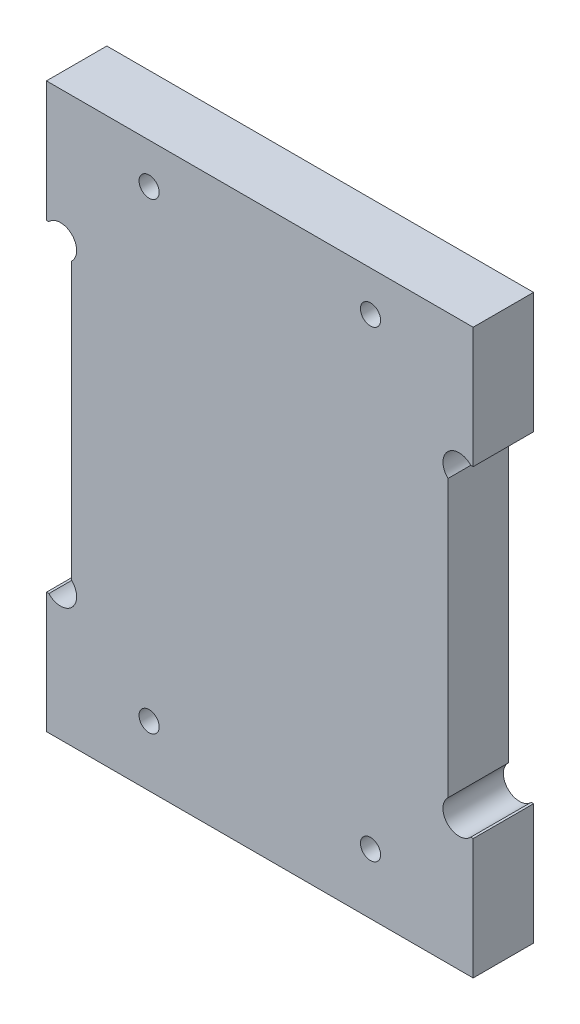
ISO-10303-21;
HEADER;
FILE_DESCRIPTION(('STEP AP214'),'2;1');
FILE_NAME('part.step','',(''),(''),'','','');
FILE_SCHEMA(('AUTOMOTIVE_DESIGN { 1 0 10303 214 1 1 1 1 }'));
ENDSEC;
DATA;
#1=APPLICATION_CONTEXT('core data for automotive mechanical design processes');
#2=APPLICATION_PROTOCOL_DEFINITION('international standard','automotive_design',2000,#1);
#3=PRODUCT_CONTEXT('',#1,'mechanical');
#4=PRODUCT('Part','Part','',(#3));
#5=PRODUCT_RELATED_PRODUCT_CATEGORY('part','',(#4));
#6=PRODUCT_DEFINITION_FORMATION('','',#4);
#7=PRODUCT_DEFINITION_CONTEXT('part definition',#1,'design');
#8=PRODUCT_DEFINITION('design','',#6,#7);
#9=PRODUCT_DEFINITION_SHAPE('','',#8);
#10=(LENGTH_UNIT() NAMED_UNIT(*) SI_UNIT(.MILLI.,.METRE.));
#11=(NAMED_UNIT(*) PLANE_ANGLE_UNIT() SI_UNIT($,.RADIAN.));
#12=(NAMED_UNIT(*) SI_UNIT($,.STERADIAN.) SOLID_ANGLE_UNIT());
#13=UNCERTAINTY_MEASURE_WITH_UNIT(LENGTH_MEASURE(1.E-05),#10,'distance_accuracy_value','');
#14=(GEOMETRIC_REPRESENTATION_CONTEXT(3) GLOBAL_UNCERTAINTY_ASSIGNED_CONTEXT((#13)) GLOBAL_UNIT_ASSIGNED_CONTEXT((#10,
#11,#12)) REPRESENTATION_CONTEXT('',''));
#15=CARTESIAN_POINT('',(0.,0.,0.));
#16=DIRECTION('',(0.,0.,1.));
#17=DIRECTION('',(1.,0.,0.));
#18=AXIS2_PLACEMENT_3D('',#15,#16,#17);
#19=CARTESIAN_POINT('',(-19.8,13.9,6.));
#20=DIRECTION('',(0.,0.,-1.));
#21=DIRECTION('',(-1.,0.,0.));
#22=AXIS2_PLACEMENT_3D('',#19,#20,#21);
#23=PLANE('',#22);
#24=CARTESIAN_POINT('',(-11.,-23.,6.));
#25=DIRECTION('',(0.,0.,1.));
#26=DIRECTION('',(-1.,0.,0.));
#27=AXIS2_PLACEMENT_3D('',#24,#25,#26);
#28=CIRCLE('',#27,1.);
#29=CARTESIAN_POINT('',(-12.,-23.,6.));
#30=VERTEX_POINT('',#29);
#31=EDGE_CURVE('E280',#30,#30,#28,.T.);
#32=ORIENTED_EDGE('',*,*,#31,.F.);
#33=EDGE_LOOP('',(#32));
#34=FACE_BOUND('',#33,.T.);
#35=CARTESIAN_POINT('',(-11.,23.,6.));
#36=DIRECTION('',(0.,0.,1.));
#37=DIRECTION('',(1.,0.,0.));
#38=AXIS2_PLACEMENT_3D('',#35,#36,#37);
#39=CIRCLE('',#38,1.);
#40=CARTESIAN_POINT('',(-10.,23.,6.));
#41=VERTEX_POINT('',#40);
#42=EDGE_CURVE('E190',#41,#41,#39,.T.);
#43=ORIENTED_EDGE('',*,*,#42,.F.);
#44=EDGE_LOOP('',(#43));
#45=FACE_BOUND('',#44,.T.);
#46=DIRECTION('',(-1.,0.,0.));
#47=VECTOR('',#46,1.);
#48=CARTESIAN_POINT('',(-24.7,27.,6.));
#49=LINE('',#48,#47);
#50=CARTESIAN_POINT('',(21.2,27.,6.));
#51=VERTEX_POINT('',#50);
#52=CARTESIAN_POINT('',(-21.2,27.,6.));
#53=VERTEX_POINT('',#52);
#54=EDGE_CURVE('E184',#51,#53,#49,.T.);
#55=ORIENTED_EDGE('',*,*,#54,.T.);
#56=DIRECTION('',(0.,1.,0.));
#57=VECTOR('',#56,1.);
#58=CARTESIAN_POINT('',(-21.2,38.8256273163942,6.));
#59=LINE('',#58,#57);
#60=CARTESIAN_POINT('',(-21.2,15.,6.));
#61=VERTEX_POINT('',#60);
#62=EDGE_CURVE('E57',#61,#53,#59,.T.);
#63=ORIENTED_EDGE('',*,*,#62,.F.);
#64=DIRECTION('',(1.,0.,0.));
#65=VECTOR('',#64,1.);
#66=CARTESIAN_POINT('',(-24.7,15.,6.));
#67=LINE('',#66,#65);
#68=CARTESIAN_POINT('',(-20.9618950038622,15.,6.));
#69=VERTEX_POINT('',#68);
#70=EDGE_CURVE('E215',#61,#69,#67,.T.);
#71=ORIENTED_EDGE('',*,*,#70,.T.);
#72=CARTESIAN_POINT('',(-19.8,13.9,6.));
#73=DIRECTION('',(0.,0.,-1.));
#74=DIRECTION('',(-1.,0.,0.));
#75=AXIS2_PLACEMENT_3D('',#72,#73,#74);
#76=CIRCLE('',#75,1.60000000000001);
#77=CARTESIAN_POINT('',(-18.7,12.7381049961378,6.));
#78=VERTEX_POINT('',#77);
#79=EDGE_CURVE('E297',#69,#78,#76,.T.);
#80=ORIENTED_EDGE('',*,*,#79,.T.);
#81=DIRECTION('',(0.,-1.,0.));
#82=VECTOR('',#81,1.);
#83=CARTESIAN_POINT('',(-18.7,12.7381049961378,6.));
#84=LINE('',#83,#82);
#85=CARTESIAN_POINT('',(-18.7,-14.7381049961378,6.));
#86=VERTEX_POINT('',#85);
#87=EDGE_CURVE('E299',#78,#86,#84,.T.);
#88=ORIENTED_EDGE('',*,*,#87,.T.);
#89=CARTESIAN_POINT('',(-19.8,-15.9,6.));
#90=DIRECTION('',(0.,0.,-1.));
#91=DIRECTION('',(-1.,0.,0.));
#92=AXIS2_PLACEMENT_3D('',#89,#90,#91);
#93=CIRCLE('',#92,1.6);
#94=CARTESIAN_POINT('',(-20.9618950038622,-17.,6.));
#95=VERTEX_POINT('',#94);
#96=EDGE_CURVE('E172',#86,#95,#93,.T.);
#97=ORIENTED_EDGE('',*,*,#96,.T.);
#98=DIRECTION('',(-1.,0.,0.));
#99=VECTOR('',#98,1.);
#100=CARTESIAN_POINT('',(-20.9618950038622,-17.,6.));
#101=LINE('',#100,#99);
#102=CARTESIAN_POINT('',(-21.2,-17.,6.));
#103=VERTEX_POINT('',#102);
#104=EDGE_CURVE('E161',#95,#103,#101,.T.);
#105=ORIENTED_EDGE('',*,*,#104,.T.);
#106=CARTESIAN_POINT('',(-21.2,-29.,6.));
#107=VERTEX_POINT('',#106);
#108=EDGE_CURVE('E146',#107,#103,#59,.T.);
#109=ORIENTED_EDGE('',*,*,#108,.F.);
#110=DIRECTION('',(1.,0.,0.));
#111=VECTOR('',#110,1.);
#112=CARTESIAN_POINT('',(24.7,-29.,6.));
#113=LINE('',#112,#111);
#114=CARTESIAN_POINT('',(21.2,-29.,6.));
#115=VERTEX_POINT('',#114);
#116=EDGE_CURVE('E158',#107,#115,#113,.T.);
#117=ORIENTED_EDGE('',*,*,#116,.T.);
#118=DIRECTION('',(0.,-1.,0.));
#119=VECTOR('',#118,1.);
#120=CARTESIAN_POINT('',(21.2,40.2838612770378,6.));
#121=LINE('',#120,#119);
#122=CARTESIAN_POINT('',(21.2,-17.,6.));
#123=VERTEX_POINT('',#122);
#124=EDGE_CURVE('E258',#123,#115,#121,.T.);
#125=ORIENTED_EDGE('',*,*,#124,.F.);
#126=DIRECTION('',(-1.,0.,0.));
#127=VECTOR('',#126,1.);
#128=CARTESIAN_POINT('',(20.9618950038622,-17.,6.));
#129=LINE('',#128,#127);
#130=CARTESIAN_POINT('',(20.9618950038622,-17.,6.));
#131=VERTEX_POINT('',#130);
#132=EDGE_CURVE('E168',#123,#131,#129,.T.);
#133=ORIENTED_EDGE('',*,*,#132,.T.);
#134=CARTESIAN_POINT('',(19.8,-15.9,6.));
#135=DIRECTION('',(0.,0.,-1.));
#136=DIRECTION('',(1.,0.,0.));
#137=AXIS2_PLACEMENT_3D('',#134,#135,#136);
#138=CIRCLE('',#137,1.6);
#139=CARTESIAN_POINT('',(18.7,-14.7381049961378,6.));
#140=VERTEX_POINT('',#139);
#141=EDGE_CURVE('E170',#131,#140,#138,.T.);
#142=ORIENTED_EDGE('',*,*,#141,.T.);
#143=DIRECTION('',(0.,1.,0.));
#144=VECTOR('',#143,1.);
#145=CARTESIAN_POINT('',(18.7,12.7381049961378,6.));
#146=LINE('',#145,#144);
#147=CARTESIAN_POINT('',(18.7,12.7381049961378,6.));
#148=VERTEX_POINT('',#147);
#149=EDGE_CURVE('E177',#140,#148,#146,.T.);
#150=ORIENTED_EDGE('',*,*,#149,.T.);
#151=CARTESIAN_POINT('',(19.8,13.9,6.));
#152=DIRECTION('',(0.,0.,-1.));
#153=DIRECTION('',(1.,0.,0.));
#154=AXIS2_PLACEMENT_3D('',#151,#152,#153);
#155=CIRCLE('',#154,1.60000000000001);
#156=CARTESIAN_POINT('',(20.9618950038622,15.,6.));
#157=VERTEX_POINT('',#156);
#158=EDGE_CURVE('E179',#148,#157,#155,.T.);
#159=ORIENTED_EDGE('',*,*,#158,.T.);
#160=DIRECTION('',(1.,0.,0.));
#161=VECTOR('',#160,1.);
#162=CARTESIAN_POINT('',(24.7,15.,6.));
#163=LINE('',#162,#161);
#164=CARTESIAN_POINT('',(21.2,15.,6.));
#165=VERTEX_POINT('',#164);
#166=EDGE_CURVE('E181',#157,#165,#163,.T.);
#167=ORIENTED_EDGE('',*,*,#166,.T.);
#168=EDGE_CURVE('E261',#51,#165,#121,.T.);
#169=ORIENTED_EDGE('',*,*,#168,.F.);
#170=EDGE_LOOP('',(#55,#63,#71,#80,#88,#97,#105,#109,#117,#125,#133,#142,#150,#159,#167,#169));
#171=FACE_BOUND('',#170,.T.);
#172=CARTESIAN_POINT('',(11.,23.,6.));
#173=DIRECTION('',(0.,0.,1.));
#174=DIRECTION('',(-1.,0.,0.));
#175=AXIS2_PLACEMENT_3D('',#172,#173,#174);
#176=CIRCLE('',#175,1.);
#177=CARTESIAN_POINT('',(10.,23.,6.));
#178=VERTEX_POINT('',#177);
#179=EDGE_CURVE('E286',#178,#178,#176,.T.);
#180=ORIENTED_EDGE('',*,*,#179,.F.);
#181=EDGE_LOOP('',(#180));
#182=FACE_BOUND('',#181,.T.);
#183=CARTESIAN_POINT('',(11.,-23.,6.));
#184=DIRECTION('',(0.,0.,1.));
#185=DIRECTION('',(1.,0.,0.));
#186=AXIS2_PLACEMENT_3D('',#183,#184,#185);
#187=CIRCLE('',#186,1.);
#188=CARTESIAN_POINT('',(12.,-23.,6.));
#189=VERTEX_POINT('',#188);
#190=EDGE_CURVE('E274',#189,#189,#187,.T.);
#191=ORIENTED_EDGE('',*,*,#190,.F.);
#192=EDGE_LOOP('',(#191));
#193=FACE_BOUND('',#192,.T.);
#194=ADVANCED_FACE('F34',(#34,#45,#171,#182,#193),#23,.F.);
#195=CARTESIAN_POINT('',(-19.8,13.9,0.));
#196=DIRECTION('',(0.,0.,-1.));
#197=DIRECTION('',(-1.,0.,0.));
#198=AXIS2_PLACEMENT_3D('',#195,#196,#197);
#199=PLANE('',#198);
#200=DIRECTION('',(0.,-1.,0.));
#201=VECTOR('',#200,1.);
#202=CARTESIAN_POINT('',(-21.2,13.9,0.));
#203=LINE('',#202,#201);
#204=CARTESIAN_POINT('',(-21.2,27.,0.));
#205=VERTEX_POINT('',#204);
#206=CARTESIAN_POINT('',(-21.2,15.,0.));
#207=VERTEX_POINT('',#206);
#208=EDGE_CURVE('E162',#205,#207,#203,.T.);
#209=ORIENTED_EDGE('',*,*,#208,.F.);
#210=DIRECTION('',(-1.,0.,0.));
#211=VECTOR('',#210,1.);
#212=CARTESIAN_POINT('',(-24.7,27.,0.));
#213=LINE('',#212,#211);
#214=CARTESIAN_POINT('',(21.2,27.,0.));
#215=VERTEX_POINT('',#214);
#216=EDGE_CURVE('E212',#215,#205,#213,.T.);
#217=ORIENTED_EDGE('',*,*,#216,.F.);
#218=DIRECTION('',(0.,1.,0.));
#219=VECTOR('',#218,1.);
#220=CARTESIAN_POINT('',(21.2,13.9,0.));
#221=LINE('',#220,#219);
#222=CARTESIAN_POINT('',(21.2,15.,0.));
#223=VERTEX_POINT('',#222);
#224=EDGE_CURVE('E251',#223,#215,#221,.T.);
#225=ORIENTED_EDGE('',*,*,#224,.F.);
#226=DIRECTION('',(1.,0.,0.));
#227=VECTOR('',#226,1.);
#228=CARTESIAN_POINT('',(24.7,15.,0.));
#229=LINE('',#228,#227);
#230=CARTESIAN_POINT('',(20.9618950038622,15.,0.));
#231=VERTEX_POINT('',#230);
#232=EDGE_CURVE('E209',#231,#223,#229,.T.);
#233=ORIENTED_EDGE('',*,*,#232,.F.);
#234=CARTESIAN_POINT('',(19.8,13.9,0.));
#235=DIRECTION('',(0.,0.,-1.));
#236=DIRECTION('',(1.,0.,0.));
#237=AXIS2_PLACEMENT_3D('',#234,#235,#236);
#238=CIRCLE('',#237,1.60000000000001);
#239=CARTESIAN_POINT('',(18.7,12.7381049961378,0.));
#240=VERTEX_POINT('',#239);
#241=EDGE_CURVE('E207',#240,#231,#238,.T.);
#242=ORIENTED_EDGE('',*,*,#241,.F.);
#243=DIRECTION('',(0.,1.,0.));
#244=VECTOR('',#243,1.);
#245=CARTESIAN_POINT('',(18.7,12.7381049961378,0.));
#246=LINE('',#245,#244);
#247=CARTESIAN_POINT('',(18.7,-14.7381049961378,0.));
#248=VERTEX_POINT('',#247);
#249=EDGE_CURVE('E205',#248,#240,#246,.T.);
#250=ORIENTED_EDGE('',*,*,#249,.F.);
#251=CARTESIAN_POINT('',(19.8,-15.9,0.));
#252=DIRECTION('',(0.,0.,-1.));
#253=DIRECTION('',(1.,0.,0.));
#254=AXIS2_PLACEMENT_3D('',#251,#252,#253);
#255=CIRCLE('',#254,1.6);
#256=CARTESIAN_POINT('',(20.9618950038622,-17.,0.));
#257=VERTEX_POINT('',#256);
#258=EDGE_CURVE('E203',#257,#248,#255,.T.);
#259=ORIENTED_EDGE('',*,*,#258,.F.);
#260=DIRECTION('',(-1.,0.,0.));
#261=VECTOR('',#260,1.);
#262=CARTESIAN_POINT('',(20.9618950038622,-17.,0.));
#263=LINE('',#262,#261);
#264=CARTESIAN_POINT('',(21.2,-17.,0.));
#265=VERTEX_POINT('',#264);
#266=EDGE_CURVE('E201',#265,#257,#263,.T.);
#267=ORIENTED_EDGE('',*,*,#266,.F.);
#268=CARTESIAN_POINT('',(21.2,-29.,0.));
#269=VERTEX_POINT('',#268);
#270=EDGE_CURVE('E266',#269,#265,#221,.T.);
#271=ORIENTED_EDGE('',*,*,#270,.F.);
#272=DIRECTION('',(1.,0.,0.));
#273=VECTOR('',#272,1.);
#274=CARTESIAN_POINT('',(24.7,-29.,0.));
#275=LINE('',#274,#273);
#276=CARTESIAN_POINT('',(-21.2,-29.,0.));
#277=VERTEX_POINT('',#276);
#278=EDGE_CURVE('E199',#277,#269,#275,.T.);
#279=ORIENTED_EDGE('',*,*,#278,.F.);
#280=CARTESIAN_POINT('',(-21.2,-17.,0.));
#281=VERTEX_POINT('',#280);
#282=EDGE_CURVE('E49',#281,#277,#203,.T.);
#283=ORIENTED_EDGE('',*,*,#282,.F.);
#284=DIRECTION('',(-1.,0.,0.));
#285=VECTOR('',#284,1.);
#286=CARTESIAN_POINT('',(-20.9618950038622,-17.,0.));
#287=LINE('',#286,#285);
#288=CARTESIAN_POINT('',(-20.9618950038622,-17.,0.));
#289=VERTEX_POINT('',#288);
#290=EDGE_CURVE('E196',#289,#281,#287,.T.);
#291=ORIENTED_EDGE('',*,*,#290,.F.);
#292=CARTESIAN_POINT('',(-19.8,-15.9,0.));
#293=DIRECTION('',(0.,0.,-1.));
#294=DIRECTION('',(-1.,0.,0.));
#295=AXIS2_PLACEMENT_3D('',#292,#293,#294);
#296=CIRCLE('',#295,1.6);
#297=CARTESIAN_POINT('',(-18.7,-14.7381049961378,0.));
#298=VERTEX_POINT('',#297);
#299=EDGE_CURVE('E194',#298,#289,#296,.T.);
#300=ORIENTED_EDGE('',*,*,#299,.F.);
#301=DIRECTION('',(0.,-1.,0.));
#302=VECTOR('',#301,1.);
#303=CARTESIAN_POINT('',(-18.7,12.7381049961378,0.));
#304=LINE('',#303,#302);
#305=CARTESIAN_POINT('',(-18.7,12.7381049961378,0.));
#306=VERTEX_POINT('',#305);
#307=EDGE_CURVE('E192',#306,#298,#304,.T.);
#308=ORIENTED_EDGE('',*,*,#307,.F.);
#309=CARTESIAN_POINT('',(-19.8,13.9,0.));
#310=DIRECTION('',(0.,0.,-1.));
#311=DIRECTION('',(-1.,0.,0.));
#312=AXIS2_PLACEMENT_3D('',#309,#310,#311);
#313=CIRCLE('',#312,1.60000000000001);
#314=CARTESIAN_POINT('',(-20.9618950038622,15.,0.));
#315=VERTEX_POINT('',#314);
#316=EDGE_CURVE('E189',#315,#306,#313,.T.);
#317=ORIENTED_EDGE('',*,*,#316,.F.);
#318=DIRECTION('',(1.,0.,0.));
#319=VECTOR('',#318,1.);
#320=CARTESIAN_POINT('',(-24.7,15.,0.));
#321=LINE('',#320,#319);
#322=EDGE_CURVE('E187',#207,#315,#321,.T.);
#323=ORIENTED_EDGE('',*,*,#322,.F.);
#324=EDGE_LOOP('',(#209,#217,#225,#233,#242,#250,#259,#267,#271,#279,#283,#291,#300,#308,#317,#323));
#325=FACE_BOUND('',#324,.T.);
#326=CARTESIAN_POINT('',(-11.,-23.,0.));
#327=DIRECTION('',(0.,0.,1.));
#328=DIRECTION('',(-1.,0.,0.));
#329=AXIS2_PLACEMENT_3D('',#326,#327,#328);
#330=CIRCLE('',#329,1.);
#331=CARTESIAN_POINT('',(-12.,-23.,0.));
#332=VERTEX_POINT('',#331);
#333=EDGE_CURVE('E277',#332,#332,#330,.T.);
#334=ORIENTED_EDGE('',*,*,#333,.T.);
#335=EDGE_LOOP('',(#334));
#336=FACE_BOUND('',#335,.T.);
#337=CARTESIAN_POINT('',(-11.,23.,0.));
#338=DIRECTION('',(0.,0.,1.));
#339=DIRECTION('',(1.,0.,0.));
#340=AXIS2_PLACEMENT_3D('',#337,#338,#339);
#341=CIRCLE('',#340,1.);
#342=CARTESIAN_POINT('',(-10.,23.,0.));
#343=VERTEX_POINT('',#342);
#344=EDGE_CURVE('E289',#343,#343,#341,.T.);
#345=ORIENTED_EDGE('',*,*,#344,.T.);
#346=EDGE_LOOP('',(#345));
#347=FACE_BOUND('',#346,.T.);
#348=CARTESIAN_POINT('',(11.,23.,0.));
#349=DIRECTION('',(0.,0.,1.));
#350=DIRECTION('',(-1.,0.,0.));
#351=AXIS2_PLACEMENT_3D('',#348,#349,#350);
#352=CIRCLE('',#351,1.);
#353=CARTESIAN_POINT('',(10.,23.,0.));
#354=VERTEX_POINT('',#353);
#355=EDGE_CURVE('E283',#354,#354,#352,.T.);
#356=ORIENTED_EDGE('',*,*,#355,.T.);
#357=EDGE_LOOP('',(#356));
#358=FACE_BOUND('',#357,.T.);
#359=CARTESIAN_POINT('',(11.,-23.,0.));
#360=DIRECTION('',(0.,0.,1.));
#361=DIRECTION('',(1.,0.,0.));
#362=AXIS2_PLACEMENT_3D('',#359,#360,#361);
#363=CIRCLE('',#362,1.);
#364=CARTESIAN_POINT('',(12.,-23.,0.));
#365=VERTEX_POINT('',#364);
#366=EDGE_CURVE('E273',#365,#365,#363,.T.);
#367=ORIENTED_EDGE('',*,*,#366,.T.);
#368=EDGE_LOOP('',(#367));
#369=FACE_BOUND('',#368,.T.);
#370=ADVANCED_FACE('F248',(#325,#336,#347,#358,#369),#199,.T.);
#371=CARTESIAN_POINT('',(-24.7,15.,6.));
#372=DIRECTION('',(0.,1.,0.));
#373=DIRECTION('',(0.,0.,1.));
#374=AXIS2_PLACEMENT_3D('',#371,#372,#373);
#375=PLANE('',#374);
#376=ORIENTED_EDGE('',*,*,#70,.F.);
#377=DIRECTION('',(0.,0.,-1.));
#378=VECTOR('',#377,1.);
#379=CARTESIAN_POINT('',(-21.2,15.,6.));
#380=LINE('',#379,#378);
#381=EDGE_CURVE('E151',#61,#207,#380,.T.);
#382=ORIENTED_EDGE('',*,*,#381,.T.);
#383=ORIENTED_EDGE('',*,*,#322,.T.);
#384=DIRECTION('',(0.,0.,-1.));
#385=VECTOR('',#384,1.);
#386=CARTESIAN_POINT('',(-20.9618950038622,15.,6.));
#387=LINE('',#386,#385);
#388=EDGE_CURVE('E236',#69,#315,#387,.T.);
#389=ORIENTED_EDGE('',*,*,#388,.F.);
#390=EDGE_LOOP('',(#376,#382,#383,#389));
#391=FACE_BOUND('',#390,.T.);
#392=ADVANCED_FACE('F36',(#391),#375,.F.);
#393=CARTESIAN_POINT('',(-19.8,13.9,6.));
#394=DIRECTION('',(0.,0.,-1.));
#395=DIRECTION('',(-1.,0.,0.));
#396=AXIS2_PLACEMENT_3D('',#393,#394,#395);
#397=CYLINDRICAL_SURFACE('',#396,1.60000000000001);
#398=ORIENTED_EDGE('',*,*,#316,.T.);
#399=DIRECTION('',(0.,0.,-1.));
#400=VECTOR('',#399,1.);
#401=CARTESIAN_POINT('',(-18.7,12.7381049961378,6.));
#402=LINE('',#401,#400);
#403=EDGE_CURVE('E233',#78,#306,#402,.T.);
#404=ORIENTED_EDGE('',*,*,#403,.F.);
#405=ORIENTED_EDGE('',*,*,#79,.F.);
#406=ORIENTED_EDGE('',*,*,#388,.T.);
#407=EDGE_LOOP('',(#398,#404,#405,#406));
#408=FACE_BOUND('',#407,.T.);
#409=ADVANCED_FACE('F378',(#408),#397,.F.);
#410=CARTESIAN_POINT('',(-18.7,12.7381049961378,6.));
#411=DIRECTION('',(1.,0.,0.));
#412=DIRECTION('',(0.,1.,0.));
#413=AXIS2_PLACEMENT_3D('',#410,#411,#412);
#414=PLANE('',#413);
#415=ORIENTED_EDGE('',*,*,#307,.T.);
#416=DIRECTION('',(0.,0.,-1.));
#417=VECTOR('',#416,1.);
#418=CARTESIAN_POINT('',(-18.7,-14.7381049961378,6.));
#419=LINE('',#418,#417);
#420=EDGE_CURVE('E230',#86,#298,#419,.T.);
#421=ORIENTED_EDGE('',*,*,#420,.F.);
#422=ORIENTED_EDGE('',*,*,#87,.F.);
#423=ORIENTED_EDGE('',*,*,#403,.T.);
#424=EDGE_LOOP('',(#415,#421,#422,#423));
#425=FACE_BOUND('',#424,.T.);
#426=ADVANCED_FACE('F318',(#425),#414,.F.);
#427=CARTESIAN_POINT('',(-19.8,-15.9,6.));
#428=DIRECTION('',(0.,0.,-1.));
#429=DIRECTION('',(-1.,0.,0.));
#430=AXIS2_PLACEMENT_3D('',#427,#428,#429);
#431=CYLINDRICAL_SURFACE('',#430,1.6);
#432=ORIENTED_EDGE('',*,*,#299,.T.);
#433=DIRECTION('',(0.,0.,-1.));
#434=VECTOR('',#433,1.);
#435=CARTESIAN_POINT('',(-20.9618950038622,-17.,6.));
#436=LINE('',#435,#434);
#437=EDGE_CURVE('E227',#95,#289,#436,.T.);
#438=ORIENTED_EDGE('',*,*,#437,.F.);
#439=ORIENTED_EDGE('',*,*,#96,.F.);
#440=ORIENTED_EDGE('',*,*,#420,.T.);
#441=EDGE_LOOP('',(#432,#438,#439,#440));
#442=FACE_BOUND('',#441,.T.);
#443=ADVANCED_FACE('F305',(#442),#431,.F.);
#444=CARTESIAN_POINT('',(-20.9618950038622,-17.,6.));
#445=DIRECTION('',(0.,-1.,0.));
#446=DIRECTION('',(1.,0.,0.));
#447=AXIS2_PLACEMENT_3D('',#444,#445,#446);
#448=PLANE('',#447);
#449=ORIENTED_EDGE('',*,*,#290,.T.);
#450=DIRECTION('',(0.,0.,1.));
#451=VECTOR('',#450,1.);
#452=CARTESIAN_POINT('',(-21.2,-17.,6.));
#453=LINE('',#452,#451);
#454=EDGE_CURVE('E257',#281,#103,#453,.T.);
#455=ORIENTED_EDGE('',*,*,#454,.T.);
#456=ORIENTED_EDGE('',*,*,#104,.F.);
#457=ORIENTED_EDGE('',*,*,#437,.T.);
#458=EDGE_LOOP('',(#449,#455,#456,#457));
#459=FACE_BOUND('',#458,.T.);
#460=ADVANCED_FACE('F308',(#459),#448,.F.);
#461=CARTESIAN_POINT('',(24.7,-29.,6.));
#462=DIRECTION('',(0.,1.,0.));
#463=DIRECTION('',(-1.,0.,0.));
#464=AXIS2_PLACEMENT_3D('',#461,#462,#463);
#465=PLANE('',#464);
#466=ORIENTED_EDGE('',*,*,#116,.F.);
#467=DIRECTION('',(0.,0.,-1.));
#468=VECTOR('',#467,1.);
#469=CARTESIAN_POINT('',(-21.2,-29.,6.));
#470=LINE('',#469,#468);
#471=EDGE_CURVE('E143',#107,#277,#470,.T.);
#472=ORIENTED_EDGE('',*,*,#471,.T.);
#473=ORIENTED_EDGE('',*,*,#278,.T.);
#474=DIRECTION('',(0.,0.,1.));
#475=VECTOR('',#474,1.);
#476=CARTESIAN_POINT('',(21.2,-29.,6.));
#477=LINE('',#476,#475);
#478=EDGE_CURVE('E167',#269,#115,#477,.T.);
#479=ORIENTED_EDGE('',*,*,#478,.T.);
#480=EDGE_LOOP('',(#466,#472,#473,#479));
#481=FACE_BOUND('',#480,.T.);
#482=ADVANCED_FACE('F165',(#481),#465,.F.);
#483=CARTESIAN_POINT('',(20.9618950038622,-17.,6.));
#484=DIRECTION('',(0.,-1.,0.));
#485=DIRECTION('',(0.,0.,-1.));
#486=AXIS2_PLACEMENT_3D('',#483,#484,#485);
#487=PLANE('',#486);
#488=ORIENTED_EDGE('',*,*,#132,.F.);
#489=DIRECTION('',(0.,0.,-1.));
#490=VECTOR('',#489,1.);
#491=CARTESIAN_POINT('',(21.2,-17.,6.));
#492=LINE('',#491,#490);
#493=EDGE_CURVE('E269',#123,#265,#492,.T.);
#494=ORIENTED_EDGE('',*,*,#493,.T.);
#495=ORIENTED_EDGE('',*,*,#266,.T.);
#496=DIRECTION('',(0.,0.,-1.));
#497=VECTOR('',#496,1.);
#498=CARTESIAN_POINT('',(20.9618950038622,-17.,6.));
#499=LINE('',#498,#497);
#500=EDGE_CURVE('E224',#131,#257,#499,.T.);
#501=ORIENTED_EDGE('',*,*,#500,.F.);
#502=EDGE_LOOP('',(#488,#494,#495,#501));
#503=FACE_BOUND('',#502,.T.);
#504=ADVANCED_FACE('F315',(#503),#487,.F.);
#505=CARTESIAN_POINT('',(19.8,-15.9,6.));
#506=DIRECTION('',(0.,0.,-1.));
#507=DIRECTION('',(-1.,0.,0.));
#508=AXIS2_PLACEMENT_3D('',#505,#506,#507);
#509=CYLINDRICAL_SURFACE('',#508,1.6);
#510=ORIENTED_EDGE('',*,*,#258,.T.);
#511=DIRECTION('',(0.,0.,-1.));
#512=VECTOR('',#511,1.);
#513=CARTESIAN_POINT('',(18.7,-14.7381049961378,6.));
#514=LINE('',#513,#512);
#515=EDGE_CURVE('E221',#140,#248,#514,.T.);
#516=ORIENTED_EDGE('',*,*,#515,.F.);
#517=ORIENTED_EDGE('',*,*,#141,.F.);
#518=ORIENTED_EDGE('',*,*,#500,.T.);
#519=EDGE_LOOP('',(#510,#516,#517,#518));
#520=FACE_BOUND('',#519,.T.);
#521=ADVANCED_FACE('F347',(#520),#509,.F.);
#522=CARTESIAN_POINT('',(18.7,12.7381049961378,6.));
#523=DIRECTION('',(-1.,0.,0.));
#524=DIRECTION('',(0.,-1.,0.));
#525=AXIS2_PLACEMENT_3D('',#522,#523,#524);
#526=PLANE('',#525);
#527=ORIENTED_EDGE('',*,*,#249,.T.);
#528=DIRECTION('',(0.,0.,-1.));
#529=VECTOR('',#528,1.);
#530=CARTESIAN_POINT('',(18.7,12.7381049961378,6.));
#531=LINE('',#530,#529);
#532=EDGE_CURVE('E218',#148,#240,#531,.T.);
#533=ORIENTED_EDGE('',*,*,#532,.F.);
#534=ORIENTED_EDGE('',*,*,#149,.F.);
#535=ORIENTED_EDGE('',*,*,#515,.T.);
#536=EDGE_LOOP('',(#527,#533,#534,#535));
#537=FACE_BOUND('',#536,.T.);
#538=ADVANCED_FACE('F343',(#537),#526,.F.);
#539=CARTESIAN_POINT('',(19.8,13.9,6.));
#540=DIRECTION('',(0.,0.,-1.));
#541=DIRECTION('',(-1.,0.,0.));
#542=AXIS2_PLACEMENT_3D('',#539,#540,#541);
#543=CYLINDRICAL_SURFACE('',#542,1.60000000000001);
#544=ORIENTED_EDGE('',*,*,#241,.T.);
#545=DIRECTION('',(0.,0.,-1.));
#546=VECTOR('',#545,1.);
#547=CARTESIAN_POINT('',(20.9618950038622,15.,6.));
#548=LINE('',#547,#546);
#549=EDGE_CURVE('E186',#157,#231,#548,.T.);
#550=ORIENTED_EDGE('',*,*,#549,.F.);
#551=ORIENTED_EDGE('',*,*,#158,.F.);
#552=ORIENTED_EDGE('',*,*,#532,.T.);
#553=EDGE_LOOP('',(#544,#550,#551,#552));
#554=FACE_BOUND('',#553,.T.);
#555=ADVANCED_FACE('F339',(#554),#543,.F.);
#556=CARTESIAN_POINT('',(24.7,15.,6.));
#557=DIRECTION('',(0.,1.,0.));
#558=DIRECTION('',(0.,0.,1.));
#559=AXIS2_PLACEMENT_3D('',#556,#557,#558);
#560=PLANE('',#559);
#561=ORIENTED_EDGE('',*,*,#232,.T.);
#562=DIRECTION('',(0.,0.,1.));
#563=VECTOR('',#562,1.);
#564=CARTESIAN_POINT('',(21.2,15.,6.));
#565=LINE('',#564,#563);
#566=EDGE_CURVE('E265',#223,#165,#565,.T.);
#567=ORIENTED_EDGE('',*,*,#566,.T.);
#568=ORIENTED_EDGE('',*,*,#166,.F.);
#569=ORIENTED_EDGE('',*,*,#549,.T.);
#570=EDGE_LOOP('',(#561,#567,#568,#569));
#571=FACE_BOUND('',#570,.T.);
#572=ADVANCED_FACE('F336',(#571),#560,.F.);
#573=CARTESIAN_POINT('',(-24.7,27.,6.));
#574=DIRECTION('',(0.,-1.,0.));
#575=DIRECTION('',(1.,0.,0.));
#576=AXIS2_PLACEMENT_3D('',#573,#574,#575);
#577=PLANE('',#576);
#578=ORIENTED_EDGE('',*,*,#216,.T.);
#579=DIRECTION('',(0.,0.,1.));
#580=VECTOR('',#579,1.);
#581=CARTESIAN_POINT('',(-21.2,27.,6.));
#582=LINE('',#581,#580);
#583=EDGE_CURVE('E11',#205,#53,#582,.T.);
#584=ORIENTED_EDGE('',*,*,#583,.T.);
#585=ORIENTED_EDGE('',*,*,#54,.F.);
#586=DIRECTION('',(0.,0.,-1.));
#587=VECTOR('',#586,1.);
#588=CARTESIAN_POINT('',(21.2,27.,6.));
#589=LINE('',#588,#587);
#590=EDGE_CURVE('E42',#51,#215,#589,.T.);
#591=ORIENTED_EDGE('',*,*,#590,.T.);
#592=EDGE_LOOP('',(#578,#584,#585,#591));
#593=FACE_BOUND('',#592,.T.);
#594=ADVANCED_FACE('F242',(#593),#577,.F.);
#595=CARTESIAN_POINT('',(-11.,23.,6.));
#596=DIRECTION('',(0.,0.,-1.));
#597=DIRECTION('',(-1.,0.,0.));
#598=AXIS2_PLACEMENT_3D('',#595,#596,#597);
#599=CYLINDRICAL_SURFACE('',#598,1.);
#600=ORIENTED_EDGE('',*,*,#42,.T.);
#601=EDGE_LOOP('',(#600));
#602=FACE_BOUND('',#601,.T.);
#603=ORIENTED_EDGE('',*,*,#344,.F.);
#604=EDGE_LOOP('',(#603));
#605=FACE_BOUND('',#604,.T.);
#606=ADVANCED_FACE('F331',(#602,#605),#599,.F.);
#607=CARTESIAN_POINT('',(11.,23.,6.));
#608=DIRECTION('',(0.,0.,-1.));
#609=DIRECTION('',(-1.,0.,0.));
#610=AXIS2_PLACEMENT_3D('',#607,#608,#609);
#611=CYLINDRICAL_SURFACE('',#610,1.);
#612=ORIENTED_EDGE('',*,*,#179,.T.);
#613=EDGE_LOOP('',(#612));
#614=FACE_BOUND('',#613,.T.);
#615=ORIENTED_EDGE('',*,*,#355,.F.);
#616=EDGE_LOOP('',(#615));
#617=FACE_BOUND('',#616,.T.);
#618=ADVANCED_FACE('F462',(#614,#617),#611,.F.);
#619=CARTESIAN_POINT('',(-11.,-23.,6.));
#620=DIRECTION('',(0.,0.,-1.));
#621=DIRECTION('',(-1.,0.,0.));
#622=AXIS2_PLACEMENT_3D('',#619,#620,#621);
#623=CYLINDRICAL_SURFACE('',#622,1.);
#624=ORIENTED_EDGE('',*,*,#31,.T.);
#625=EDGE_LOOP('',(#624));
#626=FACE_BOUND('',#625,.T.);
#627=ORIENTED_EDGE('',*,*,#333,.F.);
#628=EDGE_LOOP('',(#627));
#629=FACE_BOUND('',#628,.T.);
#630=ADVANCED_FACE('F470',(#626,#629),#623,.F.);
#631=CARTESIAN_POINT('',(11.,-23.,6.));
#632=DIRECTION('',(0.,0.,-1.));
#633=DIRECTION('',(-1.,0.,0.));
#634=AXIS2_PLACEMENT_3D('',#631,#632,#633);
#635=CYLINDRICAL_SURFACE('',#634,1.);
#636=ORIENTED_EDGE('',*,*,#190,.T.);
#637=EDGE_LOOP('',(#636));
#638=FACE_BOUND('',#637,.T.);
#639=ORIENTED_EDGE('',*,*,#366,.F.);
#640=EDGE_LOOP('',(#639));
#641=FACE_BOUND('',#640,.T.);
#642=ADVANCED_FACE('F478',(#638,#641),#635,.F.);
#643=CARTESIAN_POINT('',(21.2,40.2838612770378,-4.));
#644=DIRECTION('',(-1.,0.,0.));
#645=DIRECTION('',(0.,-1.,0.));
#646=AXIS2_PLACEMENT_3D('',#643,#644,#645);
#647=PLANE('',#646);
#648=ORIENTED_EDGE('',*,*,#224,.T.);
#649=ORIENTED_EDGE('',*,*,#590,.F.);
#650=ORIENTED_EDGE('',*,*,#168,.T.);
#651=ORIENTED_EDGE('',*,*,#566,.F.);
#652=EDGE_LOOP('',(#648,#649,#650,#651));
#653=FACE_BOUND('',#652,.T.);
#654=ADVANCED_FACE('F372',(#653),#647,.F.);
#655=ORIENTED_EDGE('',*,*,#270,.T.);
#656=ORIENTED_EDGE('',*,*,#493,.F.);
#657=ORIENTED_EDGE('',*,*,#124,.T.);
#658=ORIENTED_EDGE('',*,*,#478,.F.);
#659=EDGE_LOOP('',(#655,#656,#657,#658));
#660=FACE_BOUND('',#659,.T.);
#661=ADVANCED_FACE('F362',(#660),#647,.F.);
#662=CARTESIAN_POINT('',(-21.2,38.8256273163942,-4.));
#663=DIRECTION('',(1.,0.,0.));
#664=DIRECTION('',(0.,1.,0.));
#665=AXIS2_PLACEMENT_3D('',#662,#663,#664);
#666=PLANE('',#665);
#667=ORIENTED_EDGE('',*,*,#62,.T.);
#668=ORIENTED_EDGE('',*,*,#583,.F.);
#669=ORIENTED_EDGE('',*,*,#208,.T.);
#670=ORIENTED_EDGE('',*,*,#381,.F.);
#671=EDGE_LOOP('',(#667,#668,#669,#670));
#672=FACE_BOUND('',#671,.T.);
#673=ADVANCED_FACE('F501',(#672),#666,.F.);
#674=ORIENTED_EDGE('',*,*,#282,.T.);
#675=ORIENTED_EDGE('',*,*,#471,.F.);
#676=ORIENTED_EDGE('',*,*,#108,.T.);
#677=ORIENTED_EDGE('',*,*,#454,.F.);
#678=EDGE_LOOP('',(#674,#675,#676,#677));
#679=FACE_BOUND('',#678,.T.);
#680=ADVANCED_FACE('F145',(#679),#666,.F.);
#681=CLOSED_SHELL('',(#194,#370,#392,#409,#426,#443,#460,#482,#504,#521,#538,#555,#572,#594,
#606,#618,#630,#642,#654,#661,#673,#680));
#682=MANIFOLD_SOLID_BREP('B2',#681);
#683=ADVANCED_BREP_SHAPE_REPRESENTATION('',(#18,#682),#14);
#684=SHAPE_DEFINITION_REPRESENTATION(#9,#683);
ENDSEC;
END-ISO-10303-21;
